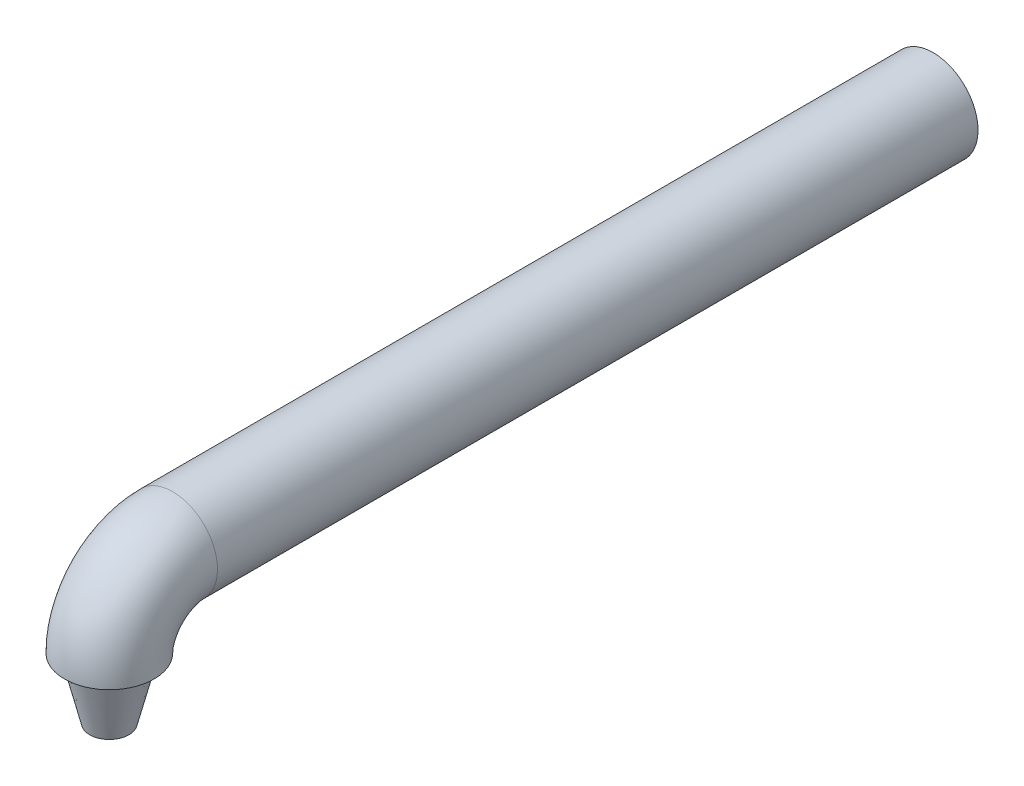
ISO-10303-21;
HEADER;
FILE_DESCRIPTION(('STEP AP214'),'2;1');
FILE_NAME('part.step','',(''),(''),'','','');
FILE_SCHEMA(('AUTOMOTIVE_DESIGN { 1 0 10303 214 1 1 1 1 }'));
ENDSEC;
DATA;
#1=APPLICATION_CONTEXT('core data for automotive mechanical design processes');
#2=APPLICATION_PROTOCOL_DEFINITION('international standard','automotive_design',2000,#1);
#3=PRODUCT_CONTEXT('',#1,'mechanical');
#4=PRODUCT('Part','Part','',(#3));
#5=PRODUCT_RELATED_PRODUCT_CATEGORY('part','',(#4));
#6=PRODUCT_DEFINITION_FORMATION('','',#4);
#7=PRODUCT_DEFINITION_CONTEXT('part definition',#1,'design');
#8=PRODUCT_DEFINITION('design','',#6,#7);
#9=PRODUCT_DEFINITION_SHAPE('','',#8);
#10=(LENGTH_UNIT() NAMED_UNIT(*) SI_UNIT(.MILLI.,.METRE.));
#11=(NAMED_UNIT(*) PLANE_ANGLE_UNIT() SI_UNIT($,.RADIAN.));
#12=(NAMED_UNIT(*) SI_UNIT($,.STERADIAN.) SOLID_ANGLE_UNIT());
#13=UNCERTAINTY_MEASURE_WITH_UNIT(LENGTH_MEASURE(1.E-05),#10,'distance_accuracy_value','');
#14=(GEOMETRIC_REPRESENTATION_CONTEXT(3) GLOBAL_UNCERTAINTY_ASSIGNED_CONTEXT((#13)) GLOBAL_UNIT_ASSIGNED_CONTEXT((#10,
#11,#12)) REPRESENTATION_CONTEXT('',''));
#15=CARTESIAN_POINT('',(0.,0.,0.));
#16=DIRECTION('',(0.,0.,1.));
#17=DIRECTION('',(1.,0.,0.));
#18=AXIS2_PLACEMENT_3D('',#15,#16,#17);
#19=CARTESIAN_POINT('',(0.,0.,0.));
#20=DIRECTION('',(0.,1.,0.));
#21=DIRECTION('',(0.,0.,1.));
#22=AXIS2_PLACEMENT_3D('',#19,#20,#21);
#23=PLANE('',#22);
#24=CARTESIAN_POINT('',(0.,0.,0.));
#25=DIRECTION('',(0.,1.,0.));
#26=DIRECTION('',(0.,0.,1.));
#27=AXIS2_PLACEMENT_3D('',#24,#25,#26);
#28=CIRCLE('',#27,4.49072);
#29=CARTESIAN_POINT('',(0.,0.,4.49072));
#30=VERTEX_POINT('',#29);
#31=EDGE_CURVE('E45',#30,#30,#28,.T.);
#32=ORIENTED_EDGE('',*,*,#31,.F.);
#33=EDGE_LOOP('',(#32));
#34=FACE_BOUND('',#33,.T.);
#35=CARTESIAN_POINT('',(0.,0.,0.));
#36=DIRECTION('',(0.,1.,0.));
#37=DIRECTION('',(0.,0.,1.));
#38=AXIS2_PLACEMENT_3D('',#35,#36,#37);
#39=CIRCLE('',#38,3.4925);
#40=CARTESIAN_POINT('',(0.,0.,3.4925));
#41=VERTEX_POINT('',#40);
#42=EDGE_CURVE('E10',#41,#41,#39,.F.);
#43=ORIENTED_EDGE('',*,*,#42,.F.);
#44=EDGE_LOOP('',(#43));
#45=FACE_BOUND('',#44,.T.);
#46=ADVANCED_FACE('F30',(#34,#45),#23,.F.);
#47=CARTESIAN_POINT('',(0.,6.35,-6.35));
#48=DIRECTION('',(0.,0.,-1.));
#49=DIRECTION('',(-1.,0.,0.));
#50=AXIS2_PLACEMENT_3D('',#47,#48,#49);
#51=CYLINDRICAL_SURFACE('',#50,4.49072);
#52=CARTESIAN_POINT('',(0.,6.35,-6.35));
#53=DIRECTION('',(0.,0.,-1.));
#54=DIRECTION('',(0.,1.,0.));
#55=AXIS2_PLACEMENT_3D('',#52,#53,#54);
#56=CIRCLE('',#55,4.49072);
#57=CARTESIAN_POINT('',(0.,10.84072,-6.35));
#58=VERTEX_POINT('',#57);
#59=EDGE_CURVE('E41',#58,#58,#56,.T.);
#60=ORIENTED_EDGE('',*,*,#59,.T.);
#61=EDGE_LOOP('',(#60));
#62=FACE_BOUND('',#61,.T.);
#63=CARTESIAN_POINT('',(0.,6.35,-82.55));
#64=DIRECTION('',(0.,0.,-1.));
#65=DIRECTION('',(0.,1.,0.));
#66=AXIS2_PLACEMENT_3D('',#63,#64,#65);
#67=CIRCLE('',#66,4.49072);
#68=CARTESIAN_POINT('',(0.,10.84072,-82.55));
#69=VERTEX_POINT('',#68);
#70=EDGE_CURVE('E37',#69,#69,#67,.T.);
#71=ORIENTED_EDGE('',*,*,#70,.F.);
#72=EDGE_LOOP('',(#71));
#73=FACE_BOUND('',#72,.T.);
#74=ADVANCED_FACE('F32',(#62,#73),#51,.T.);
#75=CARTESIAN_POINT('',(0.,0.,-6.35));
#76=DIRECTION('',(1.,0.,0.));
#77=DIRECTION('',(0.,0.,-1.));
#78=AXIS2_PLACEMENT_3D('',#75,#76,#77);
#79=TOROIDAL_SURFACE('',#78,6.35,4.49072);
#80=CARTESIAN_POINT('',(0.,0.,-6.35));
#81=DIRECTION('',(1.,0.,0.));
#82=DIRECTION('',(0.,0.,-1.));
#83=AXIS2_PLACEMENT_3D('',#80,#81,#82);
#84=CIRCLE('',#83,10.84072);
#85=EDGE_CURVE('',#58,#30,#84,.T.);
#86=ORIENTED_EDGE('',*,*,#59,.F.);
#87=ORIENTED_EDGE('',*,*,#31,.T.);
#88=ORIENTED_EDGE('',*,*,#85,.T.);
#89=ORIENTED_EDGE('',*,*,#85,.F.);
#90=EDGE_LOOP('',(#86,#88,#87,#89));
#91=FACE_BOUND('',#90,.T.);
#92=ADVANCED_FACE('F60',(#91),#79,.T.);
#93=CARTESIAN_POINT('',(0.,6.35,-82.55));
#94=DIRECTION('',(0.,0.,-1.));
#95=DIRECTION('',(0.,1.,0.));
#96=AXIS2_PLACEMENT_3D('',#93,#94,#95);
#97=PLANE('',#96);
#98=ORIENTED_EDGE('',*,*,#70,.T.);
#99=EDGE_LOOP('',(#98));
#100=FACE_BOUND('',#99,.T.);
#101=ADVANCED_FACE('F58',(#100),#97,.T.);
#102=CARTESIAN_POINT('',(0.,0.,0.));
#103=DIRECTION('',(0.,1.,0.));
#104=DIRECTION('',(0.,0.,-1.));
#105=AXIS2_PLACEMENT_3D('',#102,#103,#104);
#106=CONICAL_SURFACE('',#105,3.4925,0.244346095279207);
#107=CARTESIAN_POINT('',(0.,-6.096,0.));
#108=DIRECTION('',(0.,-1.,0.));
#109=DIRECTION('',(0.,0.,-1.));
#110=AXIS2_PLACEMENT_3D('',#107,#108,#109);
#111=CIRCLE('',#110,1.97259649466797);
#112=CARTESIAN_POINT('',(0.,-6.096,-1.97259649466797));
#113=VERTEX_POINT('',#112);
#114=EDGE_CURVE('E50',#113,#113,#111,.T.);
#115=ORIENTED_EDGE('',*,*,#114,.F.);
#116=EDGE_LOOP('',(#115));
#117=FACE_BOUND('',#116,.T.);
#118=ORIENTED_EDGE('',*,*,#42,.T.);
#119=EDGE_LOOP('',(#118));
#120=FACE_BOUND('',#119,.T.);
#121=ADVANCED_FACE('F56',(#117,#120),#106,.T.);
#122=CARTESIAN_POINT('',(0.,-6.096,0.));
#123=DIRECTION('',(0.,-1.,0.));
#124=DIRECTION('',(0.,0.,-1.));
#125=AXIS2_PLACEMENT_3D('',#122,#123,#124);
#126=PLANE('',#125);
#127=ORIENTED_EDGE('',*,*,#114,.T.);
#128=EDGE_LOOP('',(#127));
#129=FACE_BOUND('',#128,.T.);
#130=ADVANCED_FACE('F54',(#129),#126,.T.);
#131=CLOSED_SHELL('',(#46,#74,#92,#101,#121,#130));
#132=MANIFOLD_SOLID_BREP('B2',#131);
#133=ADVANCED_BREP_SHAPE_REPRESENTATION('',(#18,#132),#14);
#134=SHAPE_DEFINITION_REPRESENTATION(#9,#133);
ENDSEC;
END-ISO-10303-21;
